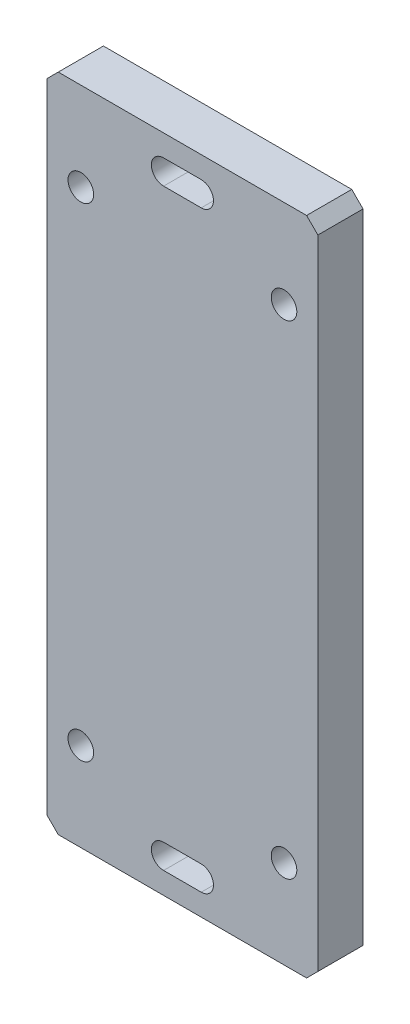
ISO-10303-21;
HEADER;
FILE_DESCRIPTION(('STEP AP214'),'2;1');
FILE_NAME('part.step','',(''),(''),'','','');
FILE_SCHEMA(('AUTOMOTIVE_DESIGN { 1 0 10303 214 1 1 1 1 }'));
ENDSEC;
DATA;
#1=APPLICATION_CONTEXT('core data for automotive mechanical design processes');
#2=APPLICATION_PROTOCOL_DEFINITION('international standard','automotive_design',2000,#1);
#3=PRODUCT_CONTEXT('',#1,'mechanical');
#4=PRODUCT('Part','Part','',(#3));
#5=PRODUCT_RELATED_PRODUCT_CATEGORY('part','',(#4));
#6=PRODUCT_DEFINITION_FORMATION('','',#4);
#7=PRODUCT_DEFINITION_CONTEXT('part definition',#1,'design');
#8=PRODUCT_DEFINITION('design','',#6,#7);
#9=PRODUCT_DEFINITION_SHAPE('','',#8);
#10=(LENGTH_UNIT() NAMED_UNIT(*) SI_UNIT(.MILLI.,.METRE.));
#11=(NAMED_UNIT(*) PLANE_ANGLE_UNIT() SI_UNIT($,.RADIAN.));
#12=(NAMED_UNIT(*) SI_UNIT($,.STERADIAN.) SOLID_ANGLE_UNIT());
#13=UNCERTAINTY_MEASURE_WITH_UNIT(LENGTH_MEASURE(1.E-05),#10,'distance_accuracy_value','');
#14=(GEOMETRIC_REPRESENTATION_CONTEXT(3) GLOBAL_UNCERTAINTY_ASSIGNED_CONTEXT((#13)) GLOBAL_UNIT_ASSIGNED_CONTEXT((#10,
#11,#12)) REPRESENTATION_CONTEXT('',''));
#15=CARTESIAN_POINT('',(0.,0.,0.));
#16=DIRECTION('',(0.,0.,1.));
#17=DIRECTION('',(1.,0.,0.));
#18=AXIS2_PLACEMENT_3D('',#15,#16,#17);
#19=CARTESIAN_POINT('',(411.720096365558,-80.9,161.52));
#20=DIRECTION('',(0.,0.,-1.));
#21=DIRECTION('',(0.,1.,0.));
#22=AXIS2_PLACEMENT_3D('',#19,#20,#21);
#23=PLANE('',#22);
#24=CARTESIAN_POINT('',(394.720096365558,-39.4000000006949,161.52));
#25=DIRECTION('',(0.,0.,1.));
#26=DIRECTION('',(1.,0.,0.));
#27=AXIS2_PLACEMENT_3D('',#24,#25,#26);
#28=CIRCLE('',#27,3.4);
#29=CARTESIAN_POINT('',(398.120096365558,-39.4000000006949,161.52));
#30=VERTEX_POINT('',#29);
#31=EDGE_CURVE('E543',#30,#30,#28,.T.);
#32=ORIENTED_EDGE('',*,*,#31,.T.);
#33=EDGE_LOOP('',(#32));
#34=FACE_BOUND('',#33,.T.);
#35=CARTESIAN_POINT('',(448.720096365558,-39.4000000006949,161.52));
#36=DIRECTION('',(0.,0.,1.));
#37=DIRECTION('',(1.,0.,0.));
#38=AXIS2_PLACEMENT_3D('',#35,#36,#37);
#39=CIRCLE('',#38,3.4);
#40=CARTESIAN_POINT('',(452.120096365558,-39.4000000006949,161.52));
#41=VERTEX_POINT('',#40);
#42=EDGE_CURVE('E553',#41,#41,#39,.T.);
#43=ORIENTED_EDGE('',*,*,#42,.T.);
#44=EDGE_LOOP('',(#43));
#45=FACE_BOUND('',#44,.T.);
#46=CARTESIAN_POINT('',(448.720096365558,-167.899999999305,161.52));
#47=DIRECTION('',(0.,0.,1.));
#48=DIRECTION('',(1.,0.,0.));
#49=AXIS2_PLACEMENT_3D('',#46,#47,#48);
#50=CIRCLE('',#49,3.4);
#51=CARTESIAN_POINT('',(452.120096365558,-167.899999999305,161.52));
#52=VERTEX_POINT('',#51);
#53=EDGE_CURVE('E559',#52,#52,#50,.T.);
#54=ORIENTED_EDGE('',*,*,#53,.T.);
#55=EDGE_LOOP('',(#54));
#56=FACE_BOUND('',#55,.T.);
#57=DIRECTION('',(1.,0.,0.));
#58=VECTOR('',#57,1.);
#59=CARTESIAN_POINT('',(411.720096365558,-15.9,161.52));
#60=LINE('',#59,#58);
#61=CARTESIAN_POINT('',(388.720096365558,-15.9,161.52));
#62=VERTEX_POINT('',#61);
#63=CARTESIAN_POINT('',(454.720096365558,-15.9,161.52));
#64=VERTEX_POINT('',#63);
#65=EDGE_CURVE('E273',#62,#64,#60,.T.);
#66=ORIENTED_EDGE('',*,*,#65,.T.);
#67=DIRECTION('',(0.707106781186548,-0.707106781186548,0.));
#68=VECTOR('',#67,1.);
#69=CARTESIAN_POINT('',(454.720096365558,-15.9,161.52));
#70=LINE('',#69,#68);
#71=CARTESIAN_POINT('',(457.720096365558,-18.9,161.52));
#72=VERTEX_POINT('',#71);
#73=EDGE_CURVE('E270',#64,#72,#70,.T.);
#74=ORIENTED_EDGE('',*,*,#73,.T.);
#75=DIRECTION('',(0.,1.,0.));
#76=VECTOR('',#75,1.);
#77=CARTESIAN_POINT('',(457.720096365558,-80.9,161.52));
#78=LINE('',#77,#76);
#79=CARTESIAN_POINT('',(457.720096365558,-188.4,161.52));
#80=VERTEX_POINT('',#79);
#81=EDGE_CURVE('E175',#72,#80,#78,.F.);
#82=ORIENTED_EDGE('',*,*,#81,.T.);
#83=DIRECTION('',(-0.707106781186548,-0.707106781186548,0.));
#84=VECTOR('',#83,1.);
#85=CARTESIAN_POINT('',(457.720096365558,-188.4,161.52));
#86=LINE('',#85,#84);
#87=CARTESIAN_POINT('',(454.720096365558,-191.4,161.52));
#88=VERTEX_POINT('',#87);
#89=EDGE_CURVE('E141',#80,#88,#86,.T.);
#90=ORIENTED_EDGE('',*,*,#89,.T.);
#91=DIRECTION('',(1.,0.,0.));
#92=VECTOR('',#91,1.);
#93=CARTESIAN_POINT('',(411.720096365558,-191.4,161.52));
#94=LINE('',#93,#92);
#95=CARTESIAN_POINT('',(388.720096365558,-191.4,161.52));
#96=VERTEX_POINT('',#95);
#97=EDGE_CURVE('E238',#88,#96,#94,.F.);
#98=ORIENTED_EDGE('',*,*,#97,.T.);
#99=DIRECTION('',(-0.707106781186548,0.707106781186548,0.));
#100=VECTOR('',#99,1.);
#101=CARTESIAN_POINT('',(388.720096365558,-191.4,161.52));
#102=LINE('',#101,#100);
#103=CARTESIAN_POINT('',(385.720096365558,-188.4,161.52));
#104=VERTEX_POINT('',#103);
#105=EDGE_CURVE('E229',#96,#104,#102,.T.);
#106=ORIENTED_EDGE('',*,*,#105,.T.);
#107=DIRECTION('',(0.,1.,0.));
#108=VECTOR('',#107,1.);
#109=CARTESIAN_POINT('',(385.720096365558,-80.9,161.52));
#110=LINE('',#109,#108);
#111=CARTESIAN_POINT('',(385.720096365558,-18.9,161.52));
#112=VERTEX_POINT('',#111);
#113=EDGE_CURVE('E237',#104,#112,#110,.T.);
#114=ORIENTED_EDGE('',*,*,#113,.T.);
#115=DIRECTION('',(0.707106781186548,0.707106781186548,0.));
#116=VECTOR('',#115,1.);
#117=CARTESIAN_POINT('',(385.720096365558,-18.9,161.52));
#118=LINE('',#117,#116);
#119=EDGE_CURVE('E275',#112,#62,#118,.T.);
#120=ORIENTED_EDGE('',*,*,#119,.T.);
#121=EDGE_LOOP('',(#66,#74,#82,#90,#98,#106,#114,#120));
#122=FACE_BOUND('',#121,.T.);
#123=DIRECTION('',(1.,0.,0.));
#124=VECTOR('',#123,1.);
#125=CARTESIAN_POINT('',(411.720096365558,-28.15,161.52));
#126=LINE('',#125,#124);
#127=CARTESIAN_POINT('',(416.720096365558,-28.15,161.52));
#128=VERTEX_POINT('',#127);
#129=CARTESIAN_POINT('',(426.720096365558,-28.15,161.52));
#130=VERTEX_POINT('',#129);
#131=EDGE_CURVE('E167',#128,#130,#126,.T.);
#132=ORIENTED_EDGE('',*,*,#131,.T.);
#133=CARTESIAN_POINT('',(426.720096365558,-24.9,161.52));
#134=DIRECTION('',(0.,0.,-1.));
#135=DIRECTION('',(0.,1.,0.));
#136=AXIS2_PLACEMENT_3D('',#133,#134,#135);
#137=CIRCLE('',#136,3.25);
#138=CARTESIAN_POINT('',(426.720096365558,-21.65,161.52));
#139=VERTEX_POINT('',#138);
#140=EDGE_CURVE('E164',#130,#139,#137,.F.);
#141=ORIENTED_EDGE('',*,*,#140,.T.);
#142=DIRECTION('',(1.,0.,0.));
#143=VECTOR('',#142,1.);
#144=CARTESIAN_POINT('',(411.720096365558,-21.65,161.52));
#145=LINE('',#144,#143);
#146=CARTESIAN_POINT('',(416.720096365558,-21.65,161.52));
#147=VERTEX_POINT('',#146);
#148=EDGE_CURVE('E171',#139,#147,#145,.F.);
#149=ORIENTED_EDGE('',*,*,#148,.T.);
#150=CARTESIAN_POINT('',(416.720096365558,-24.9,161.52));
#151=DIRECTION('',(0.,0.,-1.));
#152=DIRECTION('',(0.,1.,0.));
#153=AXIS2_PLACEMENT_3D('',#150,#151,#152);
#154=CIRCLE('',#153,3.25);
#155=EDGE_CURVE('E168',#147,#128,#154,.F.);
#156=ORIENTED_EDGE('',*,*,#155,.T.);
#157=EDGE_LOOP('',(#132,#141,#149,#156));
#158=FACE_BOUND('',#157,.T.);
#159=DIRECTION('',(1.,0.,0.));
#160=VECTOR('',#159,1.);
#161=CARTESIAN_POINT('',(411.720096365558,-185.65,161.52));
#162=LINE('',#161,#160);
#163=CARTESIAN_POINT('',(416.720096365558,-185.65,161.52));
#164=VERTEX_POINT('',#163);
#165=CARTESIAN_POINT('',(426.720096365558,-185.65,161.52));
#166=VERTEX_POINT('',#165);
#167=EDGE_CURVE('E26',#164,#166,#162,.T.);
#168=ORIENTED_EDGE('',*,*,#167,.T.);
#169=CARTESIAN_POINT('',(426.720096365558,-182.4,161.52));
#170=DIRECTION('',(0.,0.,-1.));
#171=DIRECTION('',(0.,1.,0.));
#172=AXIS2_PLACEMENT_3D('',#169,#170,#171);
#173=CIRCLE('',#172,3.25);
#174=CARTESIAN_POINT('',(426.720096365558,-179.15,161.52));
#175=VERTEX_POINT('',#174);
#176=EDGE_CURVE('E11',#166,#175,#173,.F.);
#177=ORIENTED_EDGE('',*,*,#176,.T.);
#178=DIRECTION('',(1.,0.,0.));
#179=VECTOR('',#178,1.);
#180=CARTESIAN_POINT('',(411.720096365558,-179.15,161.52));
#181=LINE('',#180,#179);
#182=CARTESIAN_POINT('',(416.720096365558,-179.15,161.52));
#183=VERTEX_POINT('',#182);
#184=EDGE_CURVE('E163',#175,#183,#181,.F.);
#185=ORIENTED_EDGE('',*,*,#184,.T.);
#186=CARTESIAN_POINT('',(416.720096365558,-182.4,161.52));
#187=DIRECTION('',(0.,0.,-1.));
#188=DIRECTION('',(0.,1.,0.));
#189=AXIS2_PLACEMENT_3D('',#186,#187,#188);
#190=CIRCLE('',#189,3.25);
#191=EDGE_CURVE('E160',#183,#164,#190,.F.);
#192=ORIENTED_EDGE('',*,*,#191,.T.);
#193=EDGE_LOOP('',(#168,#177,#185,#192));
#194=FACE_BOUND('',#193,.T.);
#195=CARTESIAN_POINT('',(394.720096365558,-167.899999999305,161.52));
#196=DIRECTION('',(0.,0.,1.));
#197=DIRECTION('',(1.,0.,0.));
#198=AXIS2_PLACEMENT_3D('',#195,#196,#197);
#199=CIRCLE('',#198,3.4);
#200=CARTESIAN_POINT('',(398.120096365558,-167.899999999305,161.52));
#201=VERTEX_POINT('',#200);
#202=EDGE_CURVE('E131',#201,#201,#199,.T.);
#203=ORIENTED_EDGE('',*,*,#202,.T.);
#204=EDGE_LOOP('',(#203));
#205=FACE_BOUND('',#204,.T.);
#206=ADVANCED_FACE('F16',(#34,#45,#56,#122,#158,#194,#205),#23,.T.);
#207=CARTESIAN_POINT('',(411.720096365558,-80.9,173.52));
#208=DIRECTION('',(0.,0.,-1.));
#209=DIRECTION('',(0.,1.,0.));
#210=AXIS2_PLACEMENT_3D('',#207,#208,#209);
#211=PLANE('',#210);
#212=CARTESIAN_POINT('',(394.720096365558,-39.4000000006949,173.52));
#213=DIRECTION('',(0.,0.,1.));
#214=DIRECTION('',(1.,0.,0.));
#215=AXIS2_PLACEMENT_3D('',#212,#213,#214);
#216=CIRCLE('',#215,3.4);
#217=CARTESIAN_POINT('',(398.120096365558,-39.4000000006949,173.52));
#218=VERTEX_POINT('',#217);
#219=EDGE_CURVE('E546',#218,#218,#216,.T.);
#220=ORIENTED_EDGE('',*,*,#219,.F.);
#221=EDGE_LOOP('',(#220));
#222=FACE_BOUND('',#221,.T.);
#223=CARTESIAN_POINT('',(448.720096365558,-39.4000000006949,173.52));
#224=DIRECTION('',(0.,0.,1.));
#225=DIRECTION('',(1.,0.,0.));
#226=AXIS2_PLACEMENT_3D('',#223,#224,#225);
#227=CIRCLE('',#226,3.4);
#228=CARTESIAN_POINT('',(452.120096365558,-39.4000000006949,173.52));
#229=VERTEX_POINT('',#228);
#230=EDGE_CURVE('E548',#229,#229,#227,.T.);
#231=ORIENTED_EDGE('',*,*,#230,.F.);
#232=EDGE_LOOP('',(#231));
#233=FACE_BOUND('',#232,.T.);
#234=CARTESIAN_POINT('',(448.720096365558,-167.899999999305,173.52));
#235=DIRECTION('',(0.,0.,1.));
#236=DIRECTION('',(1.,0.,0.));
#237=AXIS2_PLACEMENT_3D('',#234,#235,#236);
#238=CIRCLE('',#237,3.4);
#239=CARTESIAN_POINT('',(452.120096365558,-167.899999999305,173.52));
#240=VERTEX_POINT('',#239);
#241=EDGE_CURVE('E556',#240,#240,#238,.T.);
#242=ORIENTED_EDGE('',*,*,#241,.F.);
#243=EDGE_LOOP('',(#242));
#244=FACE_BOUND('',#243,.T.);
#245=CARTESIAN_POINT('',(394.720096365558,-167.899999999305,173.52));
#246=DIRECTION('',(0.,0.,1.));
#247=DIRECTION('',(1.,0.,0.));
#248=AXIS2_PLACEMENT_3D('',#245,#246,#247);
#249=CIRCLE('',#248,3.4);
#250=CARTESIAN_POINT('',(398.120096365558,-167.899999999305,173.52));
#251=VERTEX_POINT('',#250);
#252=EDGE_CURVE('E562',#251,#251,#249,.T.);
#253=ORIENTED_EDGE('',*,*,#252,.F.);
#254=EDGE_LOOP('',(#253));
#255=FACE_BOUND('',#254,.T.);
#256=DIRECTION('',(1.,0.,0.));
#257=VECTOR('',#256,1.);
#258=CARTESIAN_POINT('',(426.720096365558,-179.15,173.52));
#259=LINE('',#258,#257);
#260=CARTESIAN_POINT('',(416.720096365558,-179.15,173.52));
#261=VERTEX_POINT('',#260);
#262=CARTESIAN_POINT('',(426.720096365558,-179.15,173.52));
#263=VERTEX_POINT('',#262);
#264=EDGE_CURVE('E146',#261,#263,#259,.T.);
#265=ORIENTED_EDGE('',*,*,#264,.T.);
#266=CARTESIAN_POINT('',(426.720096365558,-182.4,173.52));
#267=DIRECTION('',(0.,0.,-1.));
#268=DIRECTION('',(0.,1.,0.));
#269=AXIS2_PLACEMENT_3D('',#266,#267,#268);
#270=CIRCLE('',#269,3.25);
#271=CARTESIAN_POINT('',(426.720096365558,-185.65,173.52));
#272=VERTEX_POINT('',#271);
#273=EDGE_CURVE('E172',#263,#272,#270,.T.);
#274=ORIENTED_EDGE('',*,*,#273,.T.);
#275=DIRECTION('',(1.,0.,0.));
#276=VECTOR('',#275,1.);
#277=CARTESIAN_POINT('',(416.720096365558,-185.65,173.52));
#278=LINE('',#277,#276);
#279=CARTESIAN_POINT('',(416.720096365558,-185.65,173.52));
#280=VERTEX_POINT('',#279);
#281=EDGE_CURVE('E150',#272,#280,#278,.F.);
#282=ORIENTED_EDGE('',*,*,#281,.T.);
#283=CARTESIAN_POINT('',(416.720096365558,-182.4,173.52));
#284=DIRECTION('',(0.,0.,-1.));
#285=DIRECTION('',(0.,1.,0.));
#286=AXIS2_PLACEMENT_3D('',#283,#284,#285);
#287=CIRCLE('',#286,3.25);
#288=EDGE_CURVE('E177',#280,#261,#287,.T.);
#289=ORIENTED_EDGE('',*,*,#288,.T.);
#290=EDGE_LOOP('',(#265,#274,#282,#289));
#291=FACE_BOUND('',#290,.T.);
#292=DIRECTION('',(1.,0.,0.));
#293=VECTOR('',#292,1.);
#294=CARTESIAN_POINT('',(416.720096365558,-28.15,173.52));
#295=LINE('',#294,#293);
#296=CARTESIAN_POINT('',(426.720096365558,-28.15,173.52));
#297=VERTEX_POINT('',#296);
#298=CARTESIAN_POINT('',(416.720096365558,-28.15,173.52));
#299=VERTEX_POINT('',#298);
#300=EDGE_CURVE('E156',#297,#299,#295,.F.);
#301=ORIENTED_EDGE('',*,*,#300,.T.);
#302=CARTESIAN_POINT('',(416.720096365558,-24.9,173.52));
#303=DIRECTION('',(0.,0.,-1.));
#304=DIRECTION('',(0.,1.,0.));
#305=AXIS2_PLACEMENT_3D('',#302,#303,#304);
#306=CIRCLE('',#305,3.25);
#307=CARTESIAN_POINT('',(416.720096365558,-21.65,173.52));
#308=VERTEX_POINT('',#307);
#309=EDGE_CURVE('E20',#299,#308,#306,.T.);
#310=ORIENTED_EDGE('',*,*,#309,.T.);
#311=DIRECTION('',(1.,0.,0.));
#312=VECTOR('',#311,1.);
#313=CARTESIAN_POINT('',(426.720096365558,-21.65,173.52));
#314=LINE('',#313,#312);
#315=CARTESIAN_POINT('',(426.720096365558,-21.65,173.52));
#316=VERTEX_POINT('',#315);
#317=EDGE_CURVE('E89',#308,#316,#314,.T.);
#318=ORIENTED_EDGE('',*,*,#317,.T.);
#319=CARTESIAN_POINT('',(426.720096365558,-24.9,173.52));
#320=DIRECTION('',(0.,0.,-1.));
#321=DIRECTION('',(0.,1.,0.));
#322=AXIS2_PLACEMENT_3D('',#319,#320,#321);
#323=CIRCLE('',#322,3.25);
#324=EDGE_CURVE('E149',#316,#297,#323,.T.);
#325=ORIENTED_EDGE('',*,*,#324,.T.);
#326=EDGE_LOOP('',(#301,#310,#318,#325));
#327=FACE_BOUND('',#326,.T.);
#328=DIRECTION('',(-0.707106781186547,-0.707106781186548,0.));
#329=VECTOR('',#328,1.);
#330=CARTESIAN_POINT('',(387.220096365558,-17.4,173.52));
#331=LINE('',#330,#329);
#332=CARTESIAN_POINT('',(385.720096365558,-18.9,173.52));
#333=VERTEX_POINT('',#332);
#334=CARTESIAN_POINT('',(388.720096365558,-15.9,173.52));
#335=VERTEX_POINT('',#334);
#336=EDGE_CURVE('E202',#333,#335,#331,.F.);
#337=ORIENTED_EDGE('',*,*,#336,.F.);
#338=DIRECTION('',(0.,1.,0.));
#339=VECTOR('',#338,1.);
#340=CARTESIAN_POINT('',(385.720096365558,-30.9,173.52));
#341=LINE('',#340,#339);
#342=CARTESIAN_POINT('',(385.720096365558,-188.4,173.52));
#343=VERTEX_POINT('',#342);
#344=EDGE_CURVE('E207',#343,#333,#341,.T.);
#345=ORIENTED_EDGE('',*,*,#344,.F.);
#346=DIRECTION('',(-0.707106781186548,0.707106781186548,0.));
#347=VECTOR('',#346,1.);
#348=CARTESIAN_POINT('',(387.220096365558,-189.9,173.52));
#349=LINE('',#348,#347);
#350=CARTESIAN_POINT('',(388.720096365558,-191.4,173.52));
#351=VERTEX_POINT('',#350);
#352=EDGE_CURVE('E215',#343,#351,#349,.F.);
#353=ORIENTED_EDGE('',*,*,#352,.T.);
#354=DIRECTION('',(1.,0.,0.));
#355=VECTOR('',#354,1.);
#356=CARTESIAN_POINT('',(385.720096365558,-191.4,173.52));
#357=LINE('',#356,#355);
#358=CARTESIAN_POINT('',(454.720096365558,-191.4,173.52));
#359=VERTEX_POINT('',#358);
#360=EDGE_CURVE('E119',#359,#351,#357,.F.);
#361=ORIENTED_EDGE('',*,*,#360,.F.);
#362=DIRECTION('',(0.707106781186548,0.707106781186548,0.));
#363=VECTOR('',#362,1.);
#364=CARTESIAN_POINT('',(456.220096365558,-189.9,173.52));
#365=LINE('',#364,#363);
#366=CARTESIAN_POINT('',(457.720096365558,-188.4,173.52));
#367=VERTEX_POINT('',#366);
#368=EDGE_CURVE('E133',#367,#359,#365,.F.);
#369=ORIENTED_EDGE('',*,*,#368,.F.);
#370=DIRECTION('',(0.,1.,0.));
#371=VECTOR('',#370,1.);
#372=CARTESIAN_POINT('',(457.720096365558,-176.4,173.52));
#373=LINE('',#372,#371);
#374=CARTESIAN_POINT('',(457.720096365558,-18.9,173.52));
#375=VERTEX_POINT('',#374);
#376=EDGE_CURVE('E97',#375,#367,#373,.F.);
#377=ORIENTED_EDGE('',*,*,#376,.F.);
#378=DIRECTION('',(-0.707106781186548,0.707106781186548,0.));
#379=VECTOR('',#378,1.);
#380=CARTESIAN_POINT('',(456.220096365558,-17.4,173.52));
#381=LINE('',#380,#379);
#382=CARTESIAN_POINT('',(454.720096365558,-15.9,173.52));
#383=VERTEX_POINT('',#382);
#384=EDGE_CURVE('E192',#383,#375,#381,.F.);
#385=ORIENTED_EDGE('',*,*,#384,.F.);
#386=DIRECTION('',(1.,0.,0.));
#387=VECTOR('',#386,1.);
#388=CARTESIAN_POINT('',(457.720096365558,-15.9,173.52));
#389=LINE('',#388,#387);
#390=EDGE_CURVE('E197',#335,#383,#389,.T.);
#391=ORIENTED_EDGE('',*,*,#390,.F.);
#392=EDGE_LOOP('',(#337,#345,#353,#361,#369,#377,#385,#391));
#393=FACE_BOUND('',#392,.T.);
#394=ADVANCED_FACE('F18',(#222,#233,#244,#255,#291,#327,#393),#211,.F.);
#395=CARTESIAN_POINT('',(457.720096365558,-176.4,173.52));
#396=DIRECTION('',(1.,0.,0.));
#397=DIRECTION('',(0.,0.,-1.));
#398=AXIS2_PLACEMENT_3D('',#395,#396,#397);
#399=PLANE('',#398);
#400=DIRECTION('',(0.,0.,1.));
#401=VECTOR('',#400,1.);
#402=CARTESIAN_POINT('',(457.720096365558,-18.9,167.52));
#403=LINE('',#402,#401);
#404=EDGE_CURVE('E129',#375,#72,#403,.F.);
#405=ORIENTED_EDGE('',*,*,#404,.F.);
#406=ORIENTED_EDGE('',*,*,#376,.T.);
#407=DIRECTION('',(0.,0.,1.));
#408=VECTOR('',#407,1.);
#409=CARTESIAN_POINT('',(457.720096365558,-188.4,167.52));
#410=LINE('',#409,#408);
#411=EDGE_CURVE('E126',#80,#367,#410,.T.);
#412=ORIENTED_EDGE('',*,*,#411,.F.);
#413=ORIENTED_EDGE('',*,*,#81,.F.);
#414=EDGE_LOOP('',(#405,#406,#412,#413));
#415=FACE_BOUND('',#414,.T.);
#416=ADVANCED_FACE('F123',(#415),#399,.T.);
#417=CARTESIAN_POINT('',(456.220096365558,-189.9,167.52));
#418=DIRECTION('',(0.707106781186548,-0.707106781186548,0.));
#419=DIRECTION('',(0.707106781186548,0.707106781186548,0.));
#420=AXIS2_PLACEMENT_3D('',#417,#418,#419);
#421=PLANE('',#420);
#422=DIRECTION('',(0.,0.,-1.));
#423=VECTOR('',#422,1.);
#424=CARTESIAN_POINT('',(454.720096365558,-191.4,173.52));
#425=LINE('',#424,#423);
#426=EDGE_CURVE('E217',#88,#359,#425,.F.);
#427=ORIENTED_EDGE('',*,*,#426,.F.);
#428=ORIENTED_EDGE('',*,*,#89,.F.);
#429=ORIENTED_EDGE('',*,*,#411,.T.);
#430=ORIENTED_EDGE('',*,*,#368,.T.);
#431=EDGE_LOOP('',(#427,#428,#429,#430));
#432=FACE_BOUND('',#431,.T.);
#433=ADVANCED_FACE('F139',(#432),#421,.T.);
#434=CARTESIAN_POINT('',(385.720096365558,-191.4,173.52));
#435=DIRECTION('',(0.,-1.,0.));
#436=DIRECTION('',(0.,0.,-1.));
#437=AXIS2_PLACEMENT_3D('',#434,#435,#436);
#438=PLANE('',#437);
#439=ORIENTED_EDGE('',*,*,#97,.F.);
#440=ORIENTED_EDGE('',*,*,#426,.T.);
#441=ORIENTED_EDGE('',*,*,#360,.T.);
#442=DIRECTION('',(0.,0.,1.));
#443=VECTOR('',#442,1.);
#444=CARTESIAN_POINT('',(388.720096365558,-191.4,167.52));
#445=LINE('',#444,#443);
#446=EDGE_CURVE('E212',#351,#96,#445,.F.);
#447=ORIENTED_EDGE('',*,*,#446,.T.);
#448=EDGE_LOOP('',(#439,#440,#441,#447));
#449=FACE_BOUND('',#448,.T.);
#450=ADVANCED_FACE('F221',(#449),#438,.T.);
#451=CARTESIAN_POINT('',(387.220096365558,-189.9,167.52));
#452=DIRECTION('',(0.707106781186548,0.707106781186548,0.));
#453=DIRECTION('',(-0.707106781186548,0.707106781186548,0.));
#454=AXIS2_PLACEMENT_3D('',#451,#452,#453);
#455=PLANE('',#454);
#456=ORIENTED_EDGE('',*,*,#105,.F.);
#457=ORIENTED_EDGE('',*,*,#446,.F.);
#458=ORIENTED_EDGE('',*,*,#352,.F.);
#459=DIRECTION('',(0.,0.,1.));
#460=VECTOR('',#459,1.);
#461=CARTESIAN_POINT('',(385.720096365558,-188.4,173.52));
#462=LINE('',#461,#460);
#463=EDGE_CURVE('E209',#104,#343,#462,.T.);
#464=ORIENTED_EDGE('',*,*,#463,.F.);
#465=EDGE_LOOP('',(#456,#457,#458,#464));
#466=FACE_BOUND('',#465,.T.);
#467=ADVANCED_FACE('F225',(#466),#455,.F.);
#468=CARTESIAN_POINT('',(385.720096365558,-30.9,173.52));
#469=DIRECTION('',(-1.,0.,0.));
#470=DIRECTION('',(0.,0.,1.));
#471=AXIS2_PLACEMENT_3D('',#468,#469,#470);
#472=PLANE('',#471);
#473=ORIENTED_EDGE('',*,*,#463,.T.);
#474=ORIENTED_EDGE('',*,*,#344,.T.);
#475=DIRECTION('',(0.,0.,1.));
#476=VECTOR('',#475,1.);
#477=CARTESIAN_POINT('',(385.720096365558,-18.9,167.52));
#478=LINE('',#477,#476);
#479=EDGE_CURVE('E204',#112,#333,#478,.T.);
#480=ORIENTED_EDGE('',*,*,#479,.F.);
#481=ORIENTED_EDGE('',*,*,#113,.F.);
#482=EDGE_LOOP('',(#473,#474,#480,#481));
#483=FACE_BOUND('',#482,.T.);
#484=ADVANCED_FACE('F283',(#483),#472,.T.);
#485=CARTESIAN_POINT('',(387.220096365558,-17.4,167.52));
#486=DIRECTION('',(-0.707106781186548,0.707106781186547,0.));
#487=DIRECTION('',(-0.707106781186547,-0.707106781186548,0.));
#488=AXIS2_PLACEMENT_3D('',#485,#486,#487);
#489=PLANE('',#488);
#490=DIRECTION('',(0.,0.,1.));
#491=VECTOR('',#490,1.);
#492=CARTESIAN_POINT('',(388.720096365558,-15.9,173.52));
#493=LINE('',#492,#491);
#494=EDGE_CURVE('E199',#62,#335,#493,.T.);
#495=ORIENTED_EDGE('',*,*,#494,.F.);
#496=ORIENTED_EDGE('',*,*,#119,.F.);
#497=ORIENTED_EDGE('',*,*,#479,.T.);
#498=ORIENTED_EDGE('',*,*,#336,.T.);
#499=EDGE_LOOP('',(#495,#496,#497,#498));
#500=FACE_BOUND('',#499,.T.);
#501=ADVANCED_FACE('F297',(#500),#489,.T.);
#502=CARTESIAN_POINT('',(457.720096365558,-15.9,173.52));
#503=DIRECTION('',(0.,1.,0.));
#504=DIRECTION('',(0.,0.,1.));
#505=AXIS2_PLACEMENT_3D('',#502,#503,#504);
#506=PLANE('',#505);
#507=ORIENTED_EDGE('',*,*,#494,.T.);
#508=ORIENTED_EDGE('',*,*,#390,.T.);
#509=DIRECTION('',(0.,0.,1.));
#510=VECTOR('',#509,1.);
#511=CARTESIAN_POINT('',(454.720096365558,-15.9,167.52));
#512=LINE('',#511,#510);
#513=EDGE_CURVE('E194',#64,#383,#512,.T.);
#514=ORIENTED_EDGE('',*,*,#513,.F.);
#515=ORIENTED_EDGE('',*,*,#65,.F.);
#516=EDGE_LOOP('',(#507,#508,#514,#515));
#517=FACE_BOUND('',#516,.T.);
#518=ADVANCED_FACE('F294',(#517),#506,.T.);
#519=CARTESIAN_POINT('',(456.220096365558,-17.4,167.52));
#520=DIRECTION('',(0.707106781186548,0.707106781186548,0.));
#521=DIRECTION('',(-0.707106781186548,0.707106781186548,0.));
#522=AXIS2_PLACEMENT_3D('',#519,#520,#521);
#523=PLANE('',#522);
#524=ORIENTED_EDGE('',*,*,#404,.T.);
#525=ORIENTED_EDGE('',*,*,#73,.F.);
#526=ORIENTED_EDGE('',*,*,#513,.T.);
#527=ORIENTED_EDGE('',*,*,#384,.T.);
#528=EDGE_LOOP('',(#524,#525,#526,#527));
#529=FACE_BOUND('',#528,.T.);
#530=ADVANCED_FACE('F289',(#529),#523,.T.);
#531=CARTESIAN_POINT('',(426.720096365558,-21.65,174.7200024));
#532=DIRECTION('',(0.,1.,0.));
#533=DIRECTION('',(0.,0.,1.));
#534=AXIS2_PLACEMENT_3D('',#531,#532,#533);
#535=PLANE('',#534);
#536=DIRECTION('',(0.,0.,-1.));
#537=VECTOR('',#536,1.);
#538=CARTESIAN_POINT('',(426.720096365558,-21.65,174.7200024));
#539=LINE('',#538,#537);
#540=EDGE_CURVE('E180',#139,#316,#539,.F.);
#541=ORIENTED_EDGE('',*,*,#540,.T.);
#542=ORIENTED_EDGE('',*,*,#317,.F.);
#543=DIRECTION('',(0.,0.,-1.));
#544=VECTOR('',#543,1.);
#545=CARTESIAN_POINT('',(416.720096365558,-21.65,174.7200024));
#546=LINE('',#545,#544);
#547=EDGE_CURVE('E155',#308,#147,#546,.T.);
#548=ORIENTED_EDGE('',*,*,#547,.T.);
#549=ORIENTED_EDGE('',*,*,#148,.F.);
#550=EDGE_LOOP('',(#541,#542,#548,#549));
#551=FACE_BOUND('',#550,.T.);
#552=ADVANCED_FACE('F351',(#551),#535,.F.);
#553=CARTESIAN_POINT('',(416.720096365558,-24.9,174.7200024));
#554=DIRECTION('',(0.,0.,-1.));
#555=DIRECTION('',(0.,1.,0.));
#556=AXIS2_PLACEMENT_3D('',#553,#554,#555);
#557=CYLINDRICAL_SURFACE('',#556,3.25);
#558=DIRECTION('',(0.,0.,-1.));
#559=VECTOR('',#558,1.);
#560=CARTESIAN_POINT('',(416.720096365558,-28.15,174.7200024));
#561=LINE('',#560,#559);
#562=EDGE_CURVE('E158',#299,#128,#561,.T.);
#563=ORIENTED_EDGE('',*,*,#562,.T.);
#564=ORIENTED_EDGE('',*,*,#155,.F.);
#565=ORIENTED_EDGE('',*,*,#547,.F.);
#566=ORIENTED_EDGE('',*,*,#309,.F.);
#567=EDGE_LOOP('',(#563,#564,#565,#566));
#568=FACE_BOUND('',#567,.T.);
#569=ADVANCED_FACE('F347',(#568),#557,.F.);
#570=CARTESIAN_POINT('',(416.720096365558,-28.15,174.7200024));
#571=DIRECTION('',(0.,-1.,0.));
#572=DIRECTION('',(0.,0.,-1.));
#573=AXIS2_PLACEMENT_3D('',#570,#571,#572);
#574=PLANE('',#573);
#575=DIRECTION('',(0.,0.,-1.));
#576=VECTOR('',#575,1.);
#577=CARTESIAN_POINT('',(426.720096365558,-28.15,174.7200024));
#578=LINE('',#577,#576);
#579=EDGE_CURVE('E157',#297,#130,#578,.T.);
#580=ORIENTED_EDGE('',*,*,#579,.T.);
#581=ORIENTED_EDGE('',*,*,#131,.F.);
#582=ORIENTED_EDGE('',*,*,#562,.F.);
#583=ORIENTED_EDGE('',*,*,#300,.F.);
#584=EDGE_LOOP('',(#580,#581,#582,#583));
#585=FACE_BOUND('',#584,.T.);
#586=ADVANCED_FACE('F343',(#585),#574,.F.);
#587=CARTESIAN_POINT('',(426.720096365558,-24.9,174.7200024));
#588=DIRECTION('',(0.,0.,-1.));
#589=DIRECTION('',(0.,1.,0.));
#590=AXIS2_PLACEMENT_3D('',#587,#588,#589);
#591=CYLINDRICAL_SURFACE('',#590,3.25);
#592=ORIENTED_EDGE('',*,*,#540,.F.);
#593=ORIENTED_EDGE('',*,*,#140,.F.);
#594=ORIENTED_EDGE('',*,*,#579,.F.);
#595=ORIENTED_EDGE('',*,*,#324,.F.);
#596=EDGE_LOOP('',(#592,#593,#594,#595));
#597=FACE_BOUND('',#596,.T.);
#598=ADVANCED_FACE('F340',(#597),#591,.F.);
#599=CARTESIAN_POINT('',(426.720096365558,-179.15,174.7200024));
#600=DIRECTION('',(0.,1.,0.));
#601=DIRECTION('',(0.,0.,1.));
#602=AXIS2_PLACEMENT_3D('',#599,#600,#601);
#603=PLANE('',#602);
#604=DIRECTION('',(0.,0.,-1.));
#605=VECTOR('',#604,1.);
#606=CARTESIAN_POINT('',(426.720096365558,-179.15,174.7200024));
#607=LINE('',#606,#605);
#608=EDGE_CURVE('E176',#175,#263,#607,.F.);
#609=ORIENTED_EDGE('',*,*,#608,.T.);
#610=ORIENTED_EDGE('',*,*,#264,.F.);
#611=DIRECTION('',(0.,0.,-1.));
#612=VECTOR('',#611,1.);
#613=CARTESIAN_POINT('',(416.720096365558,-179.15,174.7200024));
#614=LINE('',#613,#612);
#615=EDGE_CURVE('E148',#261,#183,#614,.T.);
#616=ORIENTED_EDGE('',*,*,#615,.T.);
#617=ORIENTED_EDGE('',*,*,#184,.F.);
#618=EDGE_LOOP('',(#609,#610,#616,#617));
#619=FACE_BOUND('',#618,.T.);
#620=ADVANCED_FACE('F253',(#619),#603,.F.);
#621=CARTESIAN_POINT('',(416.720096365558,-182.4,174.7200024));
#622=DIRECTION('',(0.,0.,-1.));
#623=DIRECTION('',(0.,1.,0.));
#624=AXIS2_PLACEMENT_3D('',#621,#622,#623);
#625=CYLINDRICAL_SURFACE('',#624,3.25);
#626=DIRECTION('',(0.,0.,-1.));
#627=VECTOR('',#626,1.);
#628=CARTESIAN_POINT('',(416.720096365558,-185.65,174.7200024));
#629=LINE('',#628,#627);
#630=EDGE_CURVE('E153',#280,#164,#629,.T.);
#631=ORIENTED_EDGE('',*,*,#630,.T.);
#632=ORIENTED_EDGE('',*,*,#191,.F.);
#633=ORIENTED_EDGE('',*,*,#615,.F.);
#634=ORIENTED_EDGE('',*,*,#288,.F.);
#635=EDGE_LOOP('',(#631,#632,#633,#634));
#636=FACE_BOUND('',#635,.T.);
#637=ADVANCED_FACE('F257',(#636),#625,.F.);
#638=CARTESIAN_POINT('',(416.720096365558,-185.65,174.7200024));
#639=DIRECTION('',(0.,-1.,0.));
#640=DIRECTION('',(0.,0.,-1.));
#641=AXIS2_PLACEMENT_3D('',#638,#639,#640);
#642=PLANE('',#641);
#643=DIRECTION('',(0.,0.,-1.));
#644=VECTOR('',#643,1.);
#645=CARTESIAN_POINT('',(426.720096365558,-185.65,174.7200024));
#646=LINE('',#645,#644);
#647=EDGE_CURVE('E35',#272,#166,#646,.T.);
#648=ORIENTED_EDGE('',*,*,#647,.T.);
#649=ORIENTED_EDGE('',*,*,#167,.F.);
#650=ORIENTED_EDGE('',*,*,#630,.F.);
#651=ORIENTED_EDGE('',*,*,#281,.F.);
#652=EDGE_LOOP('',(#648,#649,#650,#651));
#653=FACE_BOUND('',#652,.T.);
#654=ADVANCED_FACE('F324',(#653),#642,.F.);
#655=CARTESIAN_POINT('',(426.720096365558,-182.4,174.7200024));
#656=DIRECTION('',(0.,0.,-1.));
#657=DIRECTION('',(0.,1.,0.));
#658=AXIS2_PLACEMENT_3D('',#655,#656,#657);
#659=CYLINDRICAL_SURFACE('',#658,3.25);
#660=ORIENTED_EDGE('',*,*,#608,.F.);
#661=ORIENTED_EDGE('',*,*,#176,.F.);
#662=ORIENTED_EDGE('',*,*,#647,.F.);
#663=ORIENTED_EDGE('',*,*,#273,.F.);
#664=EDGE_LOOP('',(#660,#661,#662,#663));
#665=FACE_BOUND('',#664,.T.);
#666=ADVANCED_FACE('F312',(#665),#659,.F.);
#667=CARTESIAN_POINT('',(394.720096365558,-167.899999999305,173.52));
#668=DIRECTION('',(0.,0.,1.));
#669=DIRECTION('',(1.,0.,0.));
#670=AXIS2_PLACEMENT_3D('',#667,#668,#669);
#671=CYLINDRICAL_SURFACE('',#670,3.4);
#672=ORIENTED_EDGE('',*,*,#202,.F.);
#673=EDGE_LOOP('',(#672));
#674=FACE_BOUND('',#673,.T.);
#675=ORIENTED_EDGE('',*,*,#252,.T.);
#676=EDGE_LOOP('',(#675));
#677=FACE_BOUND('',#676,.T.);
#678=ADVANCED_FACE('F318',(#674,#677),#671,.F.);
#679=CARTESIAN_POINT('',(448.720096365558,-167.899999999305,173.52));
#680=DIRECTION('',(0.,0.,1.));
#681=DIRECTION('',(1.,0.,0.));
#682=AXIS2_PLACEMENT_3D('',#679,#680,#681);
#683=CYLINDRICAL_SURFACE('',#682,3.4);
#684=ORIENTED_EDGE('',*,*,#53,.F.);
#685=EDGE_LOOP('',(#684));
#686=FACE_BOUND('',#685,.T.);
#687=ORIENTED_EDGE('',*,*,#241,.T.);
#688=EDGE_LOOP('',(#687));
#689=FACE_BOUND('',#688,.T.);
#690=ADVANCED_FACE('F332',(#686,#689),#683,.F.);
#691=CARTESIAN_POINT('',(448.720096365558,-39.4000000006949,173.52));
#692=DIRECTION('',(0.,0.,1.));
#693=DIRECTION('',(1.,0.,0.));
#694=AXIS2_PLACEMENT_3D('',#691,#692,#693);
#695=CYLINDRICAL_SURFACE('',#694,3.4);
#696=ORIENTED_EDGE('',*,*,#42,.F.);
#697=EDGE_LOOP('',(#696));
#698=FACE_BOUND('',#697,.T.);
#699=ORIENTED_EDGE('',*,*,#230,.T.);
#700=EDGE_LOOP('',(#699));
#701=FACE_BOUND('',#700,.T.);
#702=ADVANCED_FACE('F420',(#698,#701),#695,.F.);
#703=CARTESIAN_POINT('',(394.720096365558,-39.4000000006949,173.52));
#704=DIRECTION('',(0.,0.,1.));
#705=DIRECTION('',(1.,0.,0.));
#706=AXIS2_PLACEMENT_3D('',#703,#704,#705);
#707=CYLINDRICAL_SURFACE('',#706,3.4);
#708=ORIENTED_EDGE('',*,*,#31,.F.);
#709=EDGE_LOOP('',(#708));
#710=FACE_BOUND('',#709,.T.);
#711=ORIENTED_EDGE('',*,*,#219,.T.);
#712=EDGE_LOOP('',(#711));
#713=FACE_BOUND('',#712,.T.);
#714=ADVANCED_FACE('F431',(#710,#713),#707,.F.);
#715=CLOSED_SHELL('',(#206,#394,#416,#433,#450,#467,#484,#501,#518,#530,#552,#569,#586,#598,
#620,#637,#654,#666,#678,#690,#702,#714));
#716=MANIFOLD_SOLID_BREP('B1',#715);
#717=ADVANCED_BREP_SHAPE_REPRESENTATION('',(#18,#716),#14);
#718=SHAPE_DEFINITION_REPRESENTATION(#9,#717);
ENDSEC;
END-ISO-10303-21;
